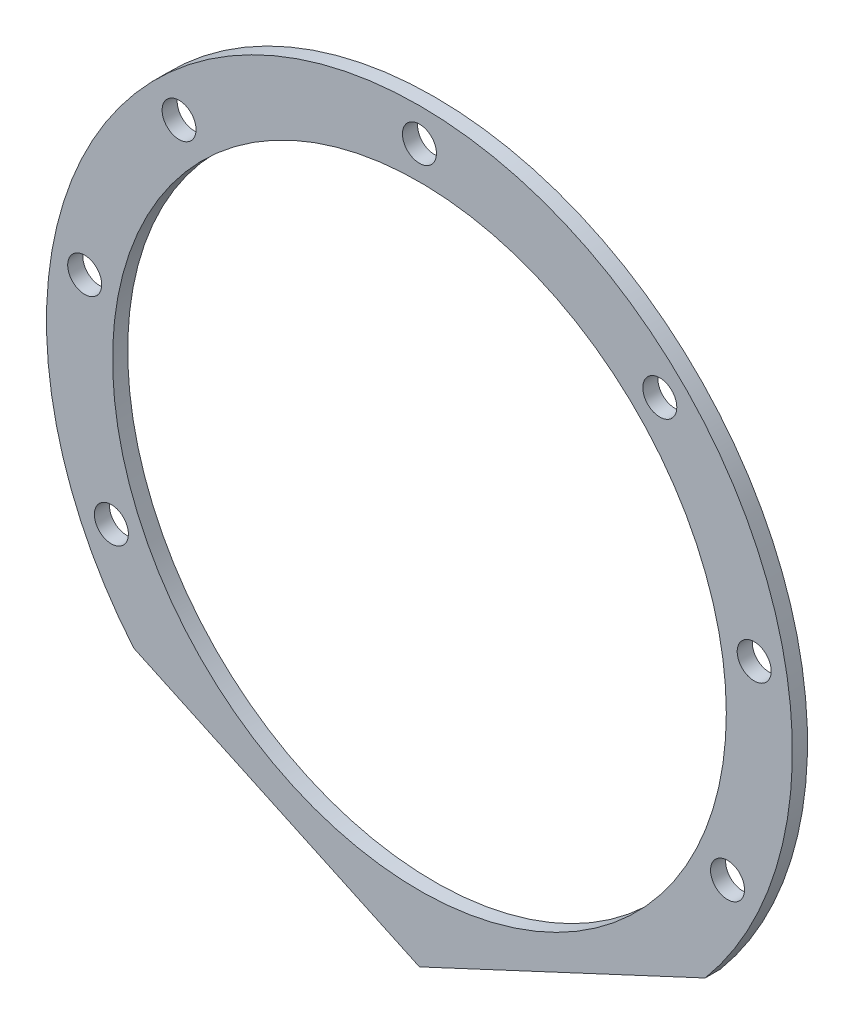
ISO-10303-21;
HEADER;
FILE_DESCRIPTION(('STEP AP214'),'2;1');
FILE_NAME('part.step','',(''),(''),'','','');
FILE_SCHEMA(('AUTOMOTIVE_DESIGN { 1 0 10303 214 1 1 1 1 }'));
ENDSEC;
DATA;
#1=APPLICATION_CONTEXT('core data for automotive mechanical design processes');
#2=APPLICATION_PROTOCOL_DEFINITION('international standard','automotive_design',2000,#1);
#3=PRODUCT_CONTEXT('',#1,'mechanical');
#4=PRODUCT('Part','Part','',(#3));
#5=PRODUCT_RELATED_PRODUCT_CATEGORY('part','',(#4));
#6=PRODUCT_DEFINITION_FORMATION('','',#4);
#7=PRODUCT_DEFINITION_CONTEXT('part definition',#1,'design');
#8=PRODUCT_DEFINITION('design','',#6,#7);
#9=PRODUCT_DEFINITION_SHAPE('','',#8);
#10=(LENGTH_UNIT() NAMED_UNIT(*) SI_UNIT(.MILLI.,.METRE.));
#11=(NAMED_UNIT(*) PLANE_ANGLE_UNIT() SI_UNIT($,.RADIAN.));
#12=(NAMED_UNIT(*) SI_UNIT($,.STERADIAN.) SOLID_ANGLE_UNIT());
#13=UNCERTAINTY_MEASURE_WITH_UNIT(LENGTH_MEASURE(1.E-05),#10,'distance_accuracy_value','');
#14=(GEOMETRIC_REPRESENTATION_CONTEXT(3) GLOBAL_UNCERTAINTY_ASSIGNED_CONTEXT((#13)) GLOBAL_UNIT_ASSIGNED_CONTEXT((#10,
#11,#12)) REPRESENTATION_CONTEXT('',''));
#15=CARTESIAN_POINT('',(0.,0.,0.));
#16=DIRECTION('',(0.,0.,1.));
#17=DIRECTION('',(1.,0.,0.));
#18=AXIS2_PLACEMENT_3D('',#15,#16,#17);
#19=CARTESIAN_POINT('',(-90.8304340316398,-239.854926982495,8.));
#20=DIRECTION('',(-0.422618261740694,0.906307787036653,0.));
#21=DIRECTION('',(-0.906307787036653,-0.422618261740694,0.));
#22=AXIS2_PLACEMENT_3D('',#19,#20,#21);
#23=PLANE('',#22);
#24=DIRECTION('',(0.906307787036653,0.422618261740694,0.));
#25=VECTOR('',#24,1.);
#26=CARTESIAN_POINT('',(-90.8304340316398,-239.854926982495,0.));
#27=LINE('',#26,#25);
#28=CARTESIAN_POINT('',(0.,-197.5,0.));
#29=VERTEX_POINT('',#28);
#30=CARTESIAN_POINT('',(151.293777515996,-126.950552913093,0.));
#31=VERTEX_POINT('',#30);
#32=EDGE_CURVE('E83',#29,#31,#27,.T.);
#33=ORIENTED_EDGE('',*,*,#32,.T.);
#34=DIRECTION('',(0.,0.,-1.));
#35=VECTOR('',#34,1.);
#36=CARTESIAN_POINT('',(151.293777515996,-126.950552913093,8.));
#37=LINE('',#36,#35);
#38=CARTESIAN_POINT('',(151.293777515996,-126.950552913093,8.));
#39=VERTEX_POINT('',#38);
#40=EDGE_CURVE('E11',#39,#31,#37,.T.);
#41=ORIENTED_EDGE('',*,*,#40,.F.);
#42=DIRECTION('',(0.906307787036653,0.422618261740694,0.));
#43=VECTOR('',#42,1.);
#44=CARTESIAN_POINT('',(-90.8304340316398,-239.854926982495,8.));
#45=LINE('',#44,#43);
#46=CARTESIAN_POINT('',(0.,-197.5,8.));
#47=VERTEX_POINT('',#46);
#48=EDGE_CURVE('E77',#47,#39,#45,.T.);
#49=ORIENTED_EDGE('',*,*,#48,.F.);
#50=DIRECTION('',(0.,0.,-1.));
#51=VECTOR('',#50,1.);
#52=CARTESIAN_POINT('',(0.,-197.5,8.));
#53=LINE('',#52,#51);
#54=EDGE_CURVE('E52',#47,#29,#53,.T.);
#55=ORIENTED_EDGE('',*,*,#54,.T.);
#56=EDGE_LOOP('',(#33,#41,#49,#55));
#57=FACE_BOUND('',#56,.T.);
#58=ADVANCED_FACE('F35',(#57),#23,.F.);
#59=CARTESIAN_POINT('',(0.,0.,8.));
#60=DIRECTION('',(0.,0.,-1.));
#61=DIRECTION('',(-1.,0.,0.));
#62=AXIS2_PLACEMENT_3D('',#59,#60,#61);
#63=CYLINDRICAL_SURFACE('',#62,197.5);
#64=CARTESIAN_POINT('',(0.,0.,0.));
#65=DIRECTION('',(0.,0.,1.));
#66=DIRECTION('',(1.,0.,0.));
#67=AXIS2_PLACEMENT_3D('',#64,#65,#66);
#68=CIRCLE('',#67,197.5);
#69=CARTESIAN_POINT('',(-151.293777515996,-126.950552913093,0.));
#70=VERTEX_POINT('',#69);
#71=EDGE_CURVE('E86',#31,#70,#68,.T.);
#72=ORIENTED_EDGE('',*,*,#71,.T.);
#73=DIRECTION('',(0.,0.,-1.));
#74=VECTOR('',#73,1.);
#75=CARTESIAN_POINT('',(-151.293777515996,-126.950552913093,8.));
#76=LINE('',#75,#74);
#77=CARTESIAN_POINT('',(-151.293777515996,-126.950552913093,8.));
#78=VERTEX_POINT('',#77);
#79=EDGE_CURVE('E44',#78,#70,#76,.T.);
#80=ORIENTED_EDGE('',*,*,#79,.F.);
#81=CARTESIAN_POINT('',(0.,0.,8.));
#82=DIRECTION('',(0.,0.,1.));
#83=DIRECTION('',(1.,0.,0.));
#84=AXIS2_PLACEMENT_3D('',#81,#82,#83);
#85=CIRCLE('',#84,197.5);
#86=EDGE_CURVE('E70',#39,#78,#85,.T.);
#87=ORIENTED_EDGE('',*,*,#86,.F.);
#88=ORIENTED_EDGE('',*,*,#40,.T.);
#89=EDGE_LOOP('',(#72,#80,#87,#88));
#90=FACE_BOUND('',#89,.T.);
#91=ADVANCED_FACE('F72',(#90),#63,.T.);
#92=CARTESIAN_POINT('',(163.135401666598,-76.0712871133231,8.));
#93=DIRECTION('',(0.,0.,-1.));
#94=DIRECTION('',(-1.,0.,0.));
#95=AXIS2_PLACEMENT_3D('',#92,#93,#94);
#96=CYLINDRICAL_SURFACE('',#95,9.00000000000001);
#97=CARTESIAN_POINT('',(163.135401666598,-76.0712871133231,8.));
#98=DIRECTION('',(0.,0.,1.));
#99=DIRECTION('',(1.,0.,0.));
#100=AXIS2_PLACEMENT_3D('',#97,#98,#99);
#101=CIRCLE('',#100,9.00000000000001);
#102=CARTESIAN_POINT('',(172.135401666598,-76.0712871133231,8.));
#103=VERTEX_POINT('',#102);
#104=EDGE_CURVE('E119',#103,#103,#101,.F.);
#105=ORIENTED_EDGE('',*,*,#104,.F.);
#106=EDGE_LOOP('',(#105));
#107=FACE_BOUND('',#106,.T.);
#108=CARTESIAN_POINT('',(163.135401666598,-76.0712871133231,0.));
#109=DIRECTION('',(0.,0.,1.));
#110=DIRECTION('',(1.,0.,0.));
#111=AXIS2_PLACEMENT_3D('',#108,#109,#110);
#112=CIRCLE('',#111,9.00000000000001);
#113=CARTESIAN_POINT('',(172.135401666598,-76.0712871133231,0.));
#114=VERTEX_POINT('',#113);
#115=EDGE_CURVE('E111',#114,#114,#112,.F.);
#116=ORIENTED_EDGE('',*,*,#115,.T.);
#117=EDGE_LOOP('',(#116));
#118=FACE_BOUND('',#117,.T.);
#119=ADVANCED_FACE('F181',(#107,#118),#96,.F.);
#120=CARTESIAN_POINT('',(0.,180.,8.));
#121=DIRECTION('',(0.,0.,-1.));
#122=DIRECTION('',(-1.,0.,0.));
#123=AXIS2_PLACEMENT_3D('',#120,#121,#122);
#124=CYLINDRICAL_SURFACE('',#123,9.00000000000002);
#125=CARTESIAN_POINT('',(0.,180.,8.));
#126=DIRECTION('',(0.,0.,1.));
#127=DIRECTION('',(1.,0.,0.));
#128=AXIS2_PLACEMENT_3D('',#125,#126,#127);
#129=CIRCLE('',#128,9.00000000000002);
#130=CARTESIAN_POINT('',(9.00000000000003,180.,8.));
#131=VERTEX_POINT('',#130);
#132=EDGE_CURVE('E123',#131,#131,#129,.T.);
#133=ORIENTED_EDGE('',*,*,#132,.T.);
#134=EDGE_LOOP('',(#133));
#135=FACE_BOUND('',#134,.T.);
#136=CARTESIAN_POINT('',(0.,180.,0.));
#137=DIRECTION('',(0.,0.,1.));
#138=DIRECTION('',(1.,0.,0.));
#139=AXIS2_PLACEMENT_3D('',#136,#137,#138);
#140=CIRCLE('',#139,9.00000000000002);
#141=CARTESIAN_POINT('',(9.00000000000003,180.,0.));
#142=VERTEX_POINT('',#141);
#143=EDGE_CURVE('E108',#142,#142,#140,.T.);
#144=ORIENTED_EDGE('',*,*,#143,.F.);
#145=EDGE_LOOP('',(#144));
#146=FACE_BOUND('',#145,.T.);
#147=ADVANCED_FACE('F201',(#135,#146),#124,.F.);
#148=CARTESIAN_POINT('',(-127.279220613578,127.279220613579,8.));
#149=DIRECTION('',(0.,0.,-1.));
#150=DIRECTION('',(-1.,0.,0.));
#151=AXIS2_PLACEMENT_3D('',#148,#149,#150);
#152=CYLINDRICAL_SURFACE('',#151,9.00000000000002);
#153=CARTESIAN_POINT('',(-127.279220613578,127.279220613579,8.));
#154=DIRECTION('',(0.,0.,1.));
#155=DIRECTION('',(1.,0.,0.));
#156=AXIS2_PLACEMENT_3D('',#153,#154,#155);
#157=CIRCLE('',#156,9.00000000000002);
#158=CARTESIAN_POINT('',(-118.279220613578,127.279220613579,8.));
#159=VERTEX_POINT('',#158);
#160=EDGE_CURVE('E128',#159,#159,#157,.T.);
#161=ORIENTED_EDGE('',*,*,#160,.T.);
#162=EDGE_LOOP('',(#161));
#163=FACE_BOUND('',#162,.T.);
#164=CARTESIAN_POINT('',(-127.279220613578,127.279220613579,0.));
#165=DIRECTION('',(0.,0.,1.));
#166=DIRECTION('',(1.,0.,0.));
#167=AXIS2_PLACEMENT_3D('',#164,#165,#166);
#168=CIRCLE('',#167,9.00000000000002);
#169=CARTESIAN_POINT('',(-118.279220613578,127.279220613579,0.));
#170=VERTEX_POINT('',#169);
#171=EDGE_CURVE('E105',#170,#170,#168,.T.);
#172=ORIENTED_EDGE('',*,*,#171,.F.);
#173=EDGE_LOOP('',(#172));
#174=FACE_BOUND('',#173,.T.);
#175=ADVANCED_FACE('F197',(#163,#174),#152,.F.);
#176=CARTESIAN_POINT('',(-177.265395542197,31.2566719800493,8.));
#177=DIRECTION('',(0.,0.,-1.));
#178=DIRECTION('',(-1.,0.,0.));
#179=AXIS2_PLACEMENT_3D('',#176,#177,#178);
#180=CYLINDRICAL_SURFACE('',#179,9.00000000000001);
#181=CARTESIAN_POINT('',(-177.265395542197,31.2566719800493,8.));
#182=DIRECTION('',(0.,0.,1.));
#183=DIRECTION('',(1.,0.,0.));
#184=AXIS2_PLACEMENT_3D('',#181,#182,#183);
#185=CIRCLE('',#184,9.00000000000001);
#186=CARTESIAN_POINT('',(-168.265395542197,31.2566719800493,8.));
#187=VERTEX_POINT('',#186);
#188=EDGE_CURVE('E131',#187,#187,#185,.T.);
#189=ORIENTED_EDGE('',*,*,#188,.T.);
#190=EDGE_LOOP('',(#189));
#191=FACE_BOUND('',#190,.T.);
#192=CARTESIAN_POINT('',(-177.265395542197,31.2566719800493,0.));
#193=DIRECTION('',(0.,0.,1.));
#194=DIRECTION('',(1.,0.,0.));
#195=AXIS2_PLACEMENT_3D('',#192,#193,#194);
#196=CIRCLE('',#195,9.00000000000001);
#197=CARTESIAN_POINT('',(-168.265395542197,31.2566719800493,0.));
#198=VERTEX_POINT('',#197);
#199=EDGE_CURVE('E102',#198,#198,#196,.T.);
#200=ORIENTED_EDGE('',*,*,#199,.F.);
#201=EDGE_LOOP('',(#200));
#202=FACE_BOUND('',#201,.T.);
#203=ADVANCED_FACE('F193',(#191,#202),#180,.F.);
#204=CARTESIAN_POINT('',(-163.135401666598,-76.0712871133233,8.));
#205=DIRECTION('',(0.,0.,-1.));
#206=DIRECTION('',(-1.,0.,0.));
#207=AXIS2_PLACEMENT_3D('',#204,#205,#206);
#208=CYLINDRICAL_SURFACE('',#207,9.00000000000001);
#209=CARTESIAN_POINT('',(-163.135401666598,-76.0712871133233,8.));
#210=DIRECTION('',(0.,0.,1.));
#211=DIRECTION('',(1.,0.,0.));
#212=AXIS2_PLACEMENT_3D('',#209,#210,#211);
#213=CIRCLE('',#212,9.00000000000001);
#214=CARTESIAN_POINT('',(-154.135401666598,-76.0712871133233,8.));
#215=VERTEX_POINT('',#214);
#216=EDGE_CURVE('E134',#215,#215,#213,.T.);
#217=ORIENTED_EDGE('',*,*,#216,.T.);
#218=EDGE_LOOP('',(#217));
#219=FACE_BOUND('',#218,.T.);
#220=CARTESIAN_POINT('',(-163.135401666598,-76.0712871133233,0.));
#221=DIRECTION('',(0.,0.,1.));
#222=DIRECTION('',(1.,0.,0.));
#223=AXIS2_PLACEMENT_3D('',#220,#221,#222);
#224=CIRCLE('',#223,9.00000000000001);
#225=CARTESIAN_POINT('',(-154.135401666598,-76.0712871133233,0.));
#226=VERTEX_POINT('',#225);
#227=EDGE_CURVE('E99',#226,#226,#224,.T.);
#228=ORIENTED_EDGE('',*,*,#227,.F.);
#229=EDGE_LOOP('',(#228));
#230=FACE_BOUND('',#229,.T.);
#231=ADVANCED_FACE('F189',(#219,#230),#208,.F.);
#232=CARTESIAN_POINT('',(0.,0.,8.));
#233=DIRECTION('',(0.,0.,-1.));
#234=DIRECTION('',(-1.,0.,0.));
#235=AXIS2_PLACEMENT_3D('',#232,#233,#234);
#236=CYLINDRICAL_SURFACE('',#235,162.5);
#237=CARTESIAN_POINT('',(0.,0.,8.));
#238=DIRECTION('',(0.,0.,1.));
#239=DIRECTION('',(1.,0.,0.));
#240=AXIS2_PLACEMENT_3D('',#237,#238,#239);
#241=CIRCLE('',#240,162.5);
#242=CARTESIAN_POINT('',(162.5,0.,8.));
#243=VERTEX_POINT('',#242);
#244=EDGE_CURVE('E137',#243,#243,#241,.T.);
#245=ORIENTED_EDGE('',*,*,#244,.T.);
#246=EDGE_LOOP('',(#245));
#247=FACE_BOUND('',#246,.T.);
#248=CARTESIAN_POINT('',(0.,0.,0.));
#249=DIRECTION('',(0.,0.,1.));
#250=DIRECTION('',(1.,0.,0.));
#251=AXIS2_PLACEMENT_3D('',#248,#249,#250);
#252=CIRCLE('',#251,162.5);
#253=CARTESIAN_POINT('',(162.5,0.,0.));
#254=VERTEX_POINT('',#253);
#255=EDGE_CURVE('E96',#254,#254,#252,.T.);
#256=ORIENTED_EDGE('',*,*,#255,.F.);
#257=EDGE_LOOP('',(#256));
#258=FACE_BOUND('',#257,.T.);
#259=ADVANCED_FACE('F186',(#247,#258),#236,.F.);
#260=CARTESIAN_POINT('',(90.8304340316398,-239.854926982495,8.));
#261=DIRECTION('',(-0.422618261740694,-0.906307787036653,0.));
#262=DIRECTION('',(0.906307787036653,-0.422618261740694,0.));
#263=AXIS2_PLACEMENT_3D('',#260,#261,#262);
#264=PLANE('',#263);
#265=DIRECTION('',(-0.906307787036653,0.422618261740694,0.));
#266=VECTOR('',#265,1.);
#267=CARTESIAN_POINT('',(90.8304340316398,-239.854926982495,0.));
#268=LINE('',#267,#266);
#269=EDGE_CURVE('E89',#29,#70,#268,.T.);
#270=ORIENTED_EDGE('',*,*,#269,.F.);
#271=ORIENTED_EDGE('',*,*,#54,.F.);
#272=DIRECTION('',(-0.906307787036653,0.422618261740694,0.));
#273=VECTOR('',#272,1.);
#274=CARTESIAN_POINT('',(90.8304340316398,-239.854926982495,8.));
#275=LINE('',#274,#273);
#276=EDGE_CURVE('E76',#47,#78,#275,.T.);
#277=ORIENTED_EDGE('',*,*,#276,.T.);
#278=ORIENTED_EDGE('',*,*,#79,.T.);
#279=EDGE_LOOP('',(#270,#271,#277,#278));
#280=FACE_BOUND('',#279,.T.);
#281=ADVANCED_FACE('F148',(#280),#264,.T.);
#282=CARTESIAN_POINT('',(177.265395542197,31.2566719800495,8.));
#283=DIRECTION('',(0.,0.,-1.));
#284=DIRECTION('',(-1.,0.,0.));
#285=AXIS2_PLACEMENT_3D('',#282,#283,#284);
#286=CYLINDRICAL_SURFACE('',#285,9.00000000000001);
#287=CARTESIAN_POINT('',(177.265395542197,31.2566719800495,8.));
#288=DIRECTION('',(0.,0.,1.));
#289=DIRECTION('',(1.,0.,0.));
#290=AXIS2_PLACEMENT_3D('',#287,#288,#289);
#291=CIRCLE('',#290,9.00000000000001);
#292=CARTESIAN_POINT('',(186.265395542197,31.2566719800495,8.));
#293=VERTEX_POINT('',#292);
#294=EDGE_CURVE('E81',#293,#293,#291,.F.);
#295=ORIENTED_EDGE('',*,*,#294,.F.);
#296=EDGE_LOOP('',(#295));
#297=FACE_BOUND('',#296,.T.);
#298=CARTESIAN_POINT('',(177.265395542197,31.2566719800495,0.));
#299=DIRECTION('',(0.,0.,1.));
#300=DIRECTION('',(1.,0.,0.));
#301=AXIS2_PLACEMENT_3D('',#298,#299,#300);
#302=CIRCLE('',#301,9.00000000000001);
#303=CARTESIAN_POINT('',(186.265395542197,31.2566719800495,0.));
#304=VERTEX_POINT('',#303);
#305=EDGE_CURVE('E87',#304,#304,#302,.F.);
#306=ORIENTED_EDGE('',*,*,#305,.T.);
#307=EDGE_LOOP('',(#306));
#308=FACE_BOUND('',#307,.T.);
#309=ADVANCED_FACE('F37',(#297,#308),#286,.F.);
#310=CARTESIAN_POINT('',(127.279220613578,127.279220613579,8.));
#311=DIRECTION('',(0.,0.,-1.));
#312=DIRECTION('',(-1.,0.,0.));
#313=AXIS2_PLACEMENT_3D('',#310,#311,#312);
#314=CYLINDRICAL_SURFACE('',#313,9.00000000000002);
#315=CARTESIAN_POINT('',(127.279220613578,127.279220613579,8.));
#316=DIRECTION('',(0.,0.,1.));
#317=DIRECTION('',(1.,0.,0.));
#318=AXIS2_PLACEMENT_3D('',#315,#316,#317);
#319=CIRCLE('',#318,9.00000000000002);
#320=CARTESIAN_POINT('',(136.279220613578,127.279220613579,8.));
#321=VERTEX_POINT('',#320);
#322=EDGE_CURVE('E117',#321,#321,#319,.F.);
#323=ORIENTED_EDGE('',*,*,#322,.F.);
#324=EDGE_LOOP('',(#323));
#325=FACE_BOUND('',#324,.T.);
#326=CARTESIAN_POINT('',(127.279220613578,127.279220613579,0.));
#327=DIRECTION('',(0.,0.,1.));
#328=DIRECTION('',(1.,0.,0.));
#329=AXIS2_PLACEMENT_3D('',#326,#327,#328);
#330=CIRCLE('',#329,9.00000000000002);
#331=CARTESIAN_POINT('',(136.279220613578,127.279220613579,0.));
#332=VERTEX_POINT('',#331);
#333=EDGE_CURVE('E114',#332,#332,#330,.F.);
#334=ORIENTED_EDGE('',*,*,#333,.T.);
#335=EDGE_LOOP('',(#334));
#336=FACE_BOUND('',#335,.T.);
#337=ADVANCED_FACE('F147',(#325,#336),#314,.F.);
#338=CARTESIAN_POINT('',(0.,-434.641421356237,8.));
#339=DIRECTION('',(0.,0.,1.));
#340=DIRECTION('',(1.,0.,0.));
#341=AXIS2_PLACEMENT_3D('',#338,#339,#340);
#342=PLANE('',#341);
#343=ORIENTED_EDGE('',*,*,#294,.T.);
#344=EDGE_LOOP('',(#343));
#345=FACE_BOUND('',#344,.T.);
#346=ORIENTED_EDGE('',*,*,#48,.T.);
#347=ORIENTED_EDGE('',*,*,#86,.T.);
#348=ORIENTED_EDGE('',*,*,#276,.F.);
#349=EDGE_LOOP('',(#346,#347,#348));
#350=FACE_BOUND('',#349,.T.);
#351=ORIENTED_EDGE('',*,*,#244,.F.);
#352=EDGE_LOOP('',(#351));
#353=FACE_BOUND('',#352,.T.);
#354=ORIENTED_EDGE('',*,*,#216,.F.);
#355=EDGE_LOOP('',(#354));
#356=FACE_BOUND('',#355,.T.);
#357=ORIENTED_EDGE('',*,*,#188,.F.);
#358=EDGE_LOOP('',(#357));
#359=FACE_BOUND('',#358,.T.);
#360=ORIENTED_EDGE('',*,*,#160,.F.);
#361=EDGE_LOOP('',(#360));
#362=FACE_BOUND('',#361,.T.);
#363=ORIENTED_EDGE('',*,*,#132,.F.);
#364=EDGE_LOOP('',(#363));
#365=FACE_BOUND('',#364,.T.);
#366=ORIENTED_EDGE('',*,*,#104,.T.);
#367=EDGE_LOOP('',(#366));
#368=FACE_BOUND('',#367,.T.);
#369=ORIENTED_EDGE('',*,*,#322,.T.);
#370=EDGE_LOOP('',(#369));
#371=FACE_BOUND('',#370,.T.);
#372=ADVANCED_FACE('F79',(#345,#350,#353,#356,#359,#362,#365,#368,#371),#342,.T.);
#373=CARTESIAN_POINT('',(0.,-434.641421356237,0.));
#374=DIRECTION('',(0.,0.,1.));
#375=DIRECTION('',(1.,0.,0.));
#376=AXIS2_PLACEMENT_3D('',#373,#374,#375);
#377=PLANE('',#376);
#378=ORIENTED_EDGE('',*,*,#305,.F.);
#379=EDGE_LOOP('',(#378));
#380=FACE_BOUND('',#379,.T.);
#381=ORIENTED_EDGE('',*,*,#32,.F.);
#382=ORIENTED_EDGE('',*,*,#269,.T.);
#383=ORIENTED_EDGE('',*,*,#71,.F.);
#384=EDGE_LOOP('',(#381,#382,#383));
#385=FACE_BOUND('',#384,.T.);
#386=ORIENTED_EDGE('',*,*,#255,.T.);
#387=EDGE_LOOP('',(#386));
#388=FACE_BOUND('',#387,.T.);
#389=ORIENTED_EDGE('',*,*,#227,.T.);
#390=EDGE_LOOP('',(#389));
#391=FACE_BOUND('',#390,.T.);
#392=ORIENTED_EDGE('',*,*,#199,.T.);
#393=EDGE_LOOP('',(#392));
#394=FACE_BOUND('',#393,.T.);
#395=ORIENTED_EDGE('',*,*,#171,.T.);
#396=EDGE_LOOP('',(#395));
#397=FACE_BOUND('',#396,.T.);
#398=ORIENTED_EDGE('',*,*,#143,.T.);
#399=EDGE_LOOP('',(#398));
#400=FACE_BOUND('',#399,.T.);
#401=ORIENTED_EDGE('',*,*,#115,.F.);
#402=EDGE_LOOP('',(#401));
#403=FACE_BOUND('',#402,.T.);
#404=ORIENTED_EDGE('',*,*,#333,.F.);
#405=EDGE_LOOP('',(#404));
#406=FACE_BOUND('',#405,.T.);
#407=ADVANCED_FACE('F151',(#380,#385,#388,#391,#394,#397,#400,#403,#406),#377,.F.);
#408=CLOSED_SHELL('',(#58,#91,#119,#147,#175,#203,#231,#259,#281,#309,#337,#372,#407));
#409=MANIFOLD_SOLID_BREP('B2',#408);
#410=ADVANCED_BREP_SHAPE_REPRESENTATION('',(#18,#409),#14);
#411=SHAPE_DEFINITION_REPRESENTATION(#9,#410);
ENDSEC;
END-ISO-10303-21;
